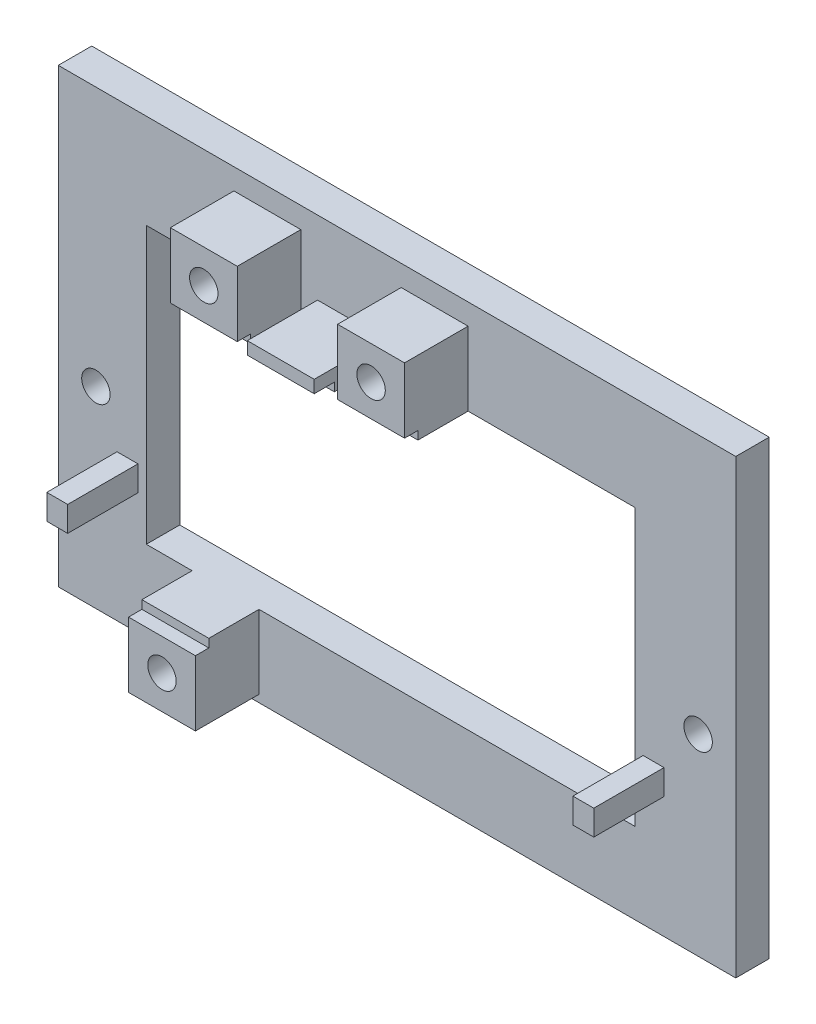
from build123d import *

# Parameters (mm, degrees)
SKETCH_1_W                        = 81
SKETCH_1_H                        = 54
SKETCH_1_R                        = 1.7
SKETCH_1_W_2                      = 58.39999938
SKETCH_1_H_2                      = 33.01900112
OPEN_BACK_TRAY_AND_M3_HOLES_DEPTH = 4
BOARD_EDGE_SHELVES_START          = 4
SKETCH_2_W                        = 8
SKETCH_2_H                        = 8.8
SKETCH_2_R                        = 1.7
SKETCH_2_H_2                      = 2.5
BOARD_EDGE_SHELVES_DEPTH          = 6
OUTSIDE_CLIP_BOSSES_START         = 10
SKETCH_3_W                        = 8
SKETCH_3_H                        = 7.8
SKETCH_3_R                        = 1.7
OUTSIDE_CLIP_BOSSES_DEPTH         = 1.6
LOWER_EDGE_GRAVITY_STOP_START     = 10
SKETCH_4_W                        = 8
SKETCH_4_H                        = 1.5
LOWER_EDGE_GRAVITY_STOP_DEPTH     = 2.4
FIXED_LEFT_RIGHT_EDGE_STOPS_START = 4
SKETCH_5_W                        = 2.5
SKETCH_5_H                        = 3
FIXED_LEFT_RIGHT_EDGE_STOPS_DEPTH = 8.4


with BuildPart() as part:
    # Sketch 1 → Open_back_tray_and_M3_holes (new body)
    with BuildSketch(Plane.XY):
        with Locations((5.5, 8)):
            Rectangle(SKETCH_1_W, SKETCH_1_H)
        with Locations((-30.5, 4)):
            Circle(SKETCH_1_R, mode=Mode.SUBTRACT)
        with Locations((41.5, 4)):
            Circle(SKETCH_1_R, mode=Mode.SUBTRACT)
        with Locations((-10, 28.49100004)):
            Circle(SKETCH_1_R, mode=Mode.SUBTRACT)
        with Locations((10, 28.49100004)):
            Circle(SKETCH_1_R, mode=Mode.SUBTRACT)
        with Locations((-15, -14.12800108)):
            Circle(SKETCH_1_R, mode=Mode.SUBTRACT)
        with Locations((4.72699969, 7.18149948)):
            Rectangle(SKETCH_1_W_2, SKETCH_1_H_2, mode=Mode.SUBTRACT)
    extrude(amount=OPEN_BACK_TRAY_AND_M3_HOLES_DEPTH)

    # Sketch 2 → Board_edge_shelves (add)
    # profile 1 of 4: a face of its own
    with BuildSketch(Plane.XY.offset(BOARD_EDGE_SHELVES_START)):
        with Locations((-10, 28.09100004)):
            Rectangle(SKETCH_2_W, SKETCH_2_H)
        with Locations((-10, 28.49100004)):
            Circle(SKETCH_2_R, mode=Mode.SUBTRACT)
    # profile 2 of 4: a face of its own
    with BuildSketch(Plane.XY.offset(BOARD_EDGE_SHELVES_START)):
        with Locations((10, 28.09100004)):
            Rectangle(SKETCH_2_W, SKETCH_2_H)
        with Locations((10, 28.49100004)):
            Circle(SKETCH_2_R, mode=Mode.SUBTRACT)
    # profile 3 of 4: a face of its own
    with BuildSketch(Plane.XY.offset(BOARD_EDGE_SHELVES_START)):
        with Locations((0, 24.94100004)):
            Rectangle(SKETCH_2_W, SKETCH_2_H_2)
    # profile 4 of 4: a face of its own
    with BuildSketch(Plane.XY.offset(BOARD_EDGE_SHELVES_START)):
        with Locations((-15, -13.72800108)):
            Rectangle(SKETCH_2_W, SKETCH_2_H)
        with Locations((-15, -14.12800108)):
            Circle(SKETCH_2_R, mode=Mode.SUBTRACT)
    extrude(amount=BOARD_EDGE_SHELVES_DEPTH)

    # Sketch 3 → Outside_clip_bosses (add)
    # profile 1 of 3: a face of its own
    with BuildSketch(Plane.XY.offset(OUTSIDE_CLIP_BOSSES_START)):
        with Locations((-10, 28.59100004)):
            Rectangle(SKETCH_3_W, SKETCH_3_H)
        with Locations((-10, 28.49100004)):
            Circle(SKETCH_3_R, mode=Mode.SUBTRACT)
    # profile 2 of 3: a face of its own
    with BuildSketch(Plane.XY.offset(OUTSIDE_CLIP_BOSSES_START)):
        with Locations((10, 28.59100004)):
            Rectangle(SKETCH_3_W, SKETCH_3_H)
        with Locations((10, 28.49100004)):
            Circle(SKETCH_3_R, mode=Mode.SUBTRACT)
    # profile 3 of 3: a face of its own
    with BuildSketch(Plane.XY.offset(OUTSIDE_CLIP_BOSSES_START)):
        with Locations((-15, -14.22800108)):
            Rectangle(SKETCH_3_W, SKETCH_3_H)
        with Locations((-15, -14.12800108)):
            Circle(SKETCH_3_R, mode=Mode.SUBTRACT)
    extrude(amount=OUTSIDE_CLIP_BOSSES_DEPTH)

    # Sketch 4 → Lower_edge_gravity_stop (add)
    with BuildSketch(Plane.XY.offset(LOWER_EDGE_GRAVITY_STOP_START)):
        with Locations((0, 25.44100004)):
            Rectangle(SKETCH_4_W, SKETCH_4_H)
    extrude(amount=LOWER_EDGE_GRAVITY_STOP_DEPTH)

    # Sketch 5 → Fixed_left_right_edge_stops (add)
    with BuildSketch(Plane.XY.offset(FIXED_LEFT_RIGHT_EDGE_STOPS_START)):
        with Locations((-26.723, -3)):
            Rectangle(SKETCH_5_W, SKETCH_5_H)
        with Locations((36.17699938, -3)):
            Rectangle(SKETCH_5_W, SKETCH_5_H)
    extrude(amount=FIXED_LEFT_RIGHT_EDGE_STOPS_DEPTH)


solid = part.part
